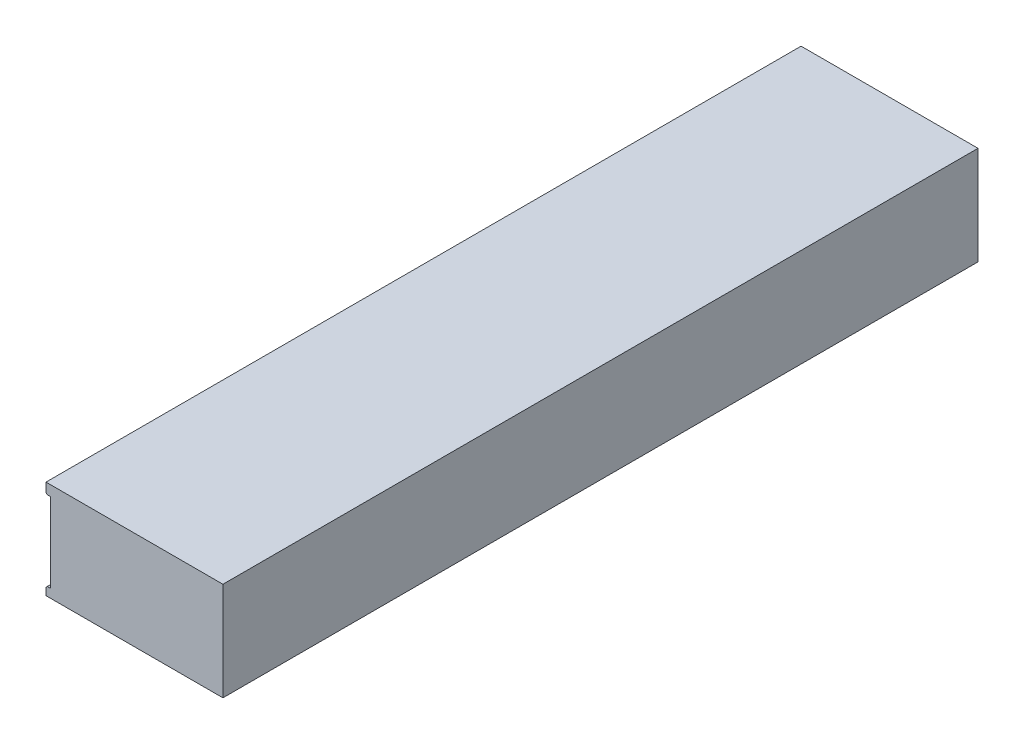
from build123d import *

# Parameters (mm, degrees)
EXTRUDE1_DEPTH                   = 111.1123
F_10_32_TAPPED_HOLE1_D           = 4.0386
F_10_32_TAPPED_HOLE1_DEPTH       = 9.99744
F_10_32_TAPPED_HOLE1_CBORE_D     = 4.826
F_10_32_TAPPED_HOLE1_CBORE_DEPTH = 7.62
F_10_32_TAPPED_HOLE1_TIP         = 1.213317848
CHAMFER1_SIZE                    = 0.381


with BuildPart() as part:
    # Sketch1 → Extrude1 (new, symmetric)
    with BuildSketch(Plane.XY):
        Polygon((50.673, 0), (50.673, -28.956), (-1.397, -28.956), (-1.397, -26.416), (0, -26.416), (0, -3.048), (-1.397, -3.048), (-1.397, 0), align=None)
    extrude(amount=EXTRUDE1_DEPTH, both=True)

    # 10-32 Tapped Hole1
    with Locations(Plane(origin=(0, -6.35, -106.2482), x_dir=(0, 0, -1), z_dir=(-1, 0, 0))):
        with Locations((0, 0), (-212.4964, 0), (-111.125, 0), (-101.3714, 0), (0, 16.764), (-101.3714, 16.764), (-111.125, 16.764), (-212.4964, 16.764), (-45.8216, 0), (-55.5752, 0), (-55.5752, 16.764), (-45.8216, 16.764), (-156.9212, 0), (-166.6748, 0), (-166.6748, 16.764), (-156.9212, 16.764)):
            CounterBoreHole(F_10_32_TAPPED_HOLE1_D / 2, F_10_32_TAPPED_HOLE1_CBORE_D / 2, F_10_32_TAPPED_HOLE1_CBORE_DEPTH, depth=F_10_32_TAPPED_HOLE1_DEPTH)
            with Locations((0, 0, -(F_10_32_TAPPED_HOLE1_DEPTH + F_10_32_TAPPED_HOLE1_TIP / 2))):  # 118° drill point
                Cone(0, F_10_32_TAPPED_HOLE1_D / 2, F_10_32_TAPPED_HOLE1_TIP, mode=Mode.SUBTRACT)

    # Chamfer1
    chamfer1_edges = [part.edges().sort_by_distance(p)[0] for p in [
        (-1.397, -26.416, 0),
        (-1.397, -3.048, 0),
    ]]
    chamfer(chamfer1_edges, length=CHAMFER1_SIZE)


solid = part.part
